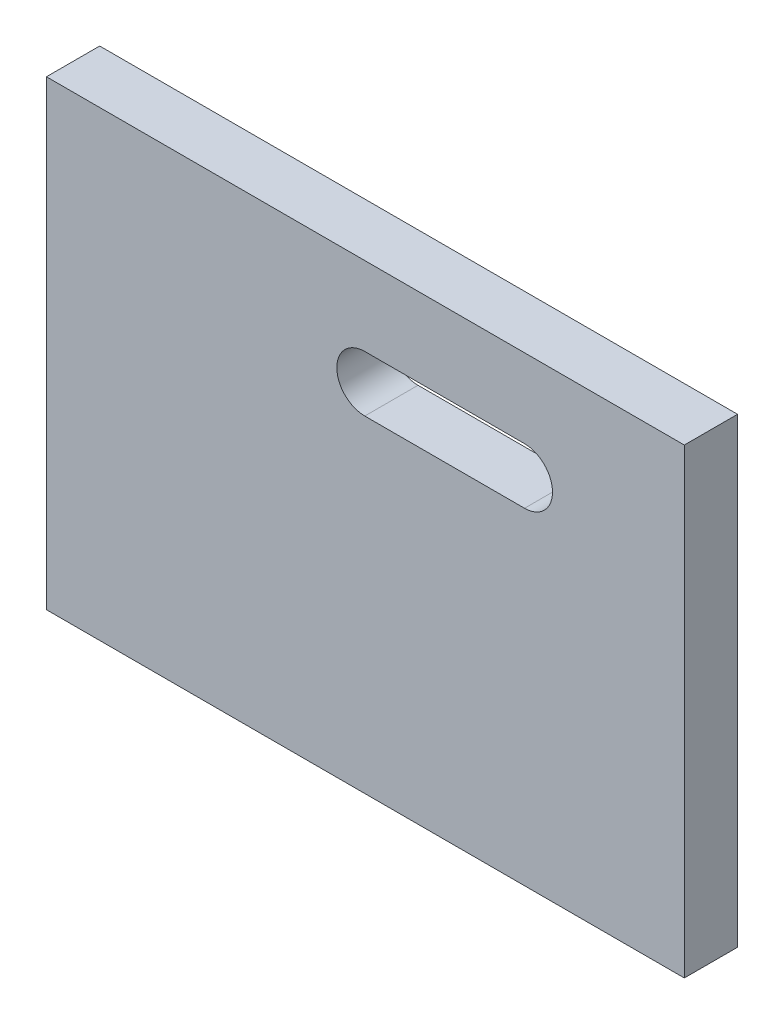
ISO-10303-21;
HEADER;
FILE_DESCRIPTION(('STEP AP214'),'2;1');
FILE_NAME('part.step','',(''),(''),'','','');
FILE_SCHEMA(('AUTOMOTIVE_DESIGN { 1 0 10303 214 1 1 1 1 }'));
ENDSEC;
DATA;
#1=APPLICATION_CONTEXT('core data for automotive mechanical design processes');
#2=APPLICATION_PROTOCOL_DEFINITION('international standard','automotive_design',2000,#1);
#3=PRODUCT_CONTEXT('',#1,'mechanical');
#4=PRODUCT('Part','Part','',(#3));
#5=PRODUCT_RELATED_PRODUCT_CATEGORY('part','',(#4));
#6=PRODUCT_DEFINITION_FORMATION('','',#4);
#7=PRODUCT_DEFINITION_CONTEXT('part definition',#1,'design');
#8=PRODUCT_DEFINITION('design','',#6,#7);
#9=PRODUCT_DEFINITION_SHAPE('','',#8);
#10=(LENGTH_UNIT() NAMED_UNIT(*) SI_UNIT(.MILLI.,.METRE.));
#11=(NAMED_UNIT(*) PLANE_ANGLE_UNIT() SI_UNIT($,.RADIAN.));
#12=(NAMED_UNIT(*) SI_UNIT($,.STERADIAN.) SOLID_ANGLE_UNIT());
#13=UNCERTAINTY_MEASURE_WITH_UNIT(LENGTH_MEASURE(1.E-05),#10,'distance_accuracy_value','');
#14=(GEOMETRIC_REPRESENTATION_CONTEXT(3) GLOBAL_UNCERTAINTY_ASSIGNED_CONTEXT((#13)) GLOBAL_UNIT_ASSIGNED_CONTEXT((#10,
#11,#12)) REPRESENTATION_CONTEXT('',''));
#15=CARTESIAN_POINT('',(0.,0.,0.));
#16=DIRECTION('',(0.,0.,1.));
#17=DIRECTION('',(1.,0.,0.));
#18=AXIS2_PLACEMENT_3D('',#15,#16,#17);
#19=CARTESIAN_POINT('',(-71.6424785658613,-40.9755851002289,10.));
#20=DIRECTION('',(0.,0.,1.));
#21=DIRECTION('',(1.,0.,0.));
#22=AXIS2_PLACEMENT_3D('',#19,#20,#21);
#23=PLANE('',#22);
#24=DIRECTION('',(0.,-1.,0.));
#25=VECTOR('',#24,1.);
#26=CARTESIAN_POINT('',(-71.6424785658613,45.6972130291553,10.));
#27=LINE('',#26,#25);
#28=CARTESIAN_POINT('',(-71.6424785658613,45.6972130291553,10.));
#29=VERTEX_POINT('',#28);
#30=CARTESIAN_POINT('',(-71.6424785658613,-40.9755851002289,10.));
#31=VERTEX_POINT('',#30);
#32=EDGE_CURVE('E142',#29,#31,#27,.T.);
#33=ORIENTED_EDGE('',*,*,#32,.T.);
#34=DIRECTION('',(1.,0.,0.));
#35=VECTOR('',#34,1.);
#36=CARTESIAN_POINT('',(-71.6424785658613,-40.9755851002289,10.));
#37=LINE('',#36,#35);
#38=CARTESIAN_POINT('',(48.1314886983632,-40.9755851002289,10.));
#39=VERTEX_POINT('',#38);
#40=EDGE_CURVE('E145',#31,#39,#37,.T.);
#41=ORIENTED_EDGE('',*,*,#40,.T.);
#42=DIRECTION('',(0.,1.,0.));
#43=VECTOR('',#42,1.);
#44=CARTESIAN_POINT('',(48.1314886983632,45.6972130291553,10.));
#45=LINE('',#44,#43);
#46=CARTESIAN_POINT('',(48.1314886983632,45.6972130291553,10.));
#47=VERTEX_POINT('',#46);
#48=EDGE_CURVE('E147',#39,#47,#45,.T.);
#49=ORIENTED_EDGE('',*,*,#48,.T.);
#50=DIRECTION('',(-1.,0.,0.));
#51=VECTOR('',#50,1.);
#52=CARTESIAN_POINT('',(-71.6424785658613,45.6972130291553,10.));
#53=LINE('',#52,#51);
#54=EDGE_CURVE('E149',#47,#29,#53,.T.);
#55=ORIENTED_EDGE('',*,*,#54,.T.);
#56=EDGE_LOOP('',(#33,#41,#49,#55));
#57=FACE_BOUND('',#56,.T.);
#58=DIRECTION('',(-1.,0.,0.));
#59=VECTOR('',#58,1.);
#60=CARTESIAN_POINT('',(18.1314886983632,30.9122948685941,10.));
#61=LINE('',#60,#59);
#62=CARTESIAN_POINT('',(18.1314886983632,30.9122948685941,10.));
#63=VERTEX_POINT('',#62);
#64=CARTESIAN_POINT('',(-11.8685113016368,30.9122948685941,10.));
#65=VERTEX_POINT('',#64);
#66=EDGE_CURVE('E124',#63,#65,#61,.T.);
#67=ORIENTED_EDGE('',*,*,#66,.F.);
#68=CARTESIAN_POINT('',(18.1314886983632,25.6622948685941,10.));
#69=DIRECTION('',(0.,0.,1.));
#70=DIRECTION('',(1.,0.,0.));
#71=AXIS2_PLACEMENT_3D('',#68,#69,#70);
#72=CIRCLE('',#71,5.25);
#73=CARTESIAN_POINT('',(18.1314886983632,20.4122948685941,10.));
#74=VERTEX_POINT('',#73);
#75=EDGE_CURVE('E113',#74,#63,#72,.T.);
#76=ORIENTED_EDGE('',*,*,#75,.F.);
#77=DIRECTION('',(1.,0.,0.));
#78=VECTOR('',#77,1.);
#79=CARTESIAN_POINT('',(-11.8685113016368,20.4122948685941,10.));
#80=LINE('',#79,#78);
#81=CARTESIAN_POINT('',(-11.8685113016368,20.4122948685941,10.));
#82=VERTEX_POINT('',#81);
#83=EDGE_CURVE('E128',#82,#74,#80,.T.);
#84=ORIENTED_EDGE('',*,*,#83,.F.);
#85=CARTESIAN_POINT('',(-11.8685113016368,25.6622948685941,10.));
#86=DIRECTION('',(0.,0.,1.));
#87=DIRECTION('',(1.,0.,0.));
#88=AXIS2_PLACEMENT_3D('',#85,#86,#87);
#89=CIRCLE('',#88,5.25);
#90=EDGE_CURVE('E126',#65,#82,#89,.T.);
#91=ORIENTED_EDGE('',*,*,#90,.F.);
#92=EDGE_LOOP('',(#67,#76,#84,#91));
#93=FACE_BOUND('',#92,.T.);
#94=ADVANCED_FACE('F33',(#57,#93),#23,.T.);
#95=CARTESIAN_POINT('',(-71.6424785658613,-40.9755851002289,0.));
#96=DIRECTION('',(0.,0.,1.));
#97=DIRECTION('',(1.,0.,0.));
#98=AXIS2_PLACEMENT_3D('',#95,#96,#97);
#99=PLANE('',#98);
#100=DIRECTION('',(0.,-1.,0.));
#101=VECTOR('',#100,1.);
#102=CARTESIAN_POINT('',(-71.6424785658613,45.6972130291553,0.));
#103=LINE('',#102,#101);
#104=CARTESIAN_POINT('',(-71.6424785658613,45.6972130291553,0.));
#105=VERTEX_POINT('',#104);
#106=CARTESIAN_POINT('',(-71.6424785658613,-40.9755851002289,0.));
#107=VERTEX_POINT('',#106);
#108=EDGE_CURVE('E114',#105,#107,#103,.T.);
#109=ORIENTED_EDGE('',*,*,#108,.F.);
#110=DIRECTION('',(-1.,0.,0.));
#111=VECTOR('',#110,1.);
#112=CARTESIAN_POINT('',(-71.6424785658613,45.6972130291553,0.));
#113=LINE('',#112,#111);
#114=CARTESIAN_POINT('',(48.1314886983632,45.6972130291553,0.));
#115=VERTEX_POINT('',#114);
#116=EDGE_CURVE('E140',#115,#105,#113,.T.);
#117=ORIENTED_EDGE('',*,*,#116,.F.);
#118=DIRECTION('',(0.,1.,0.));
#119=VECTOR('',#118,1.);
#120=CARTESIAN_POINT('',(48.1314886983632,45.6972130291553,0.));
#121=LINE('',#120,#119);
#122=CARTESIAN_POINT('',(48.1314886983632,-40.9755851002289,0.));
#123=VERTEX_POINT('',#122);
#124=EDGE_CURVE('E138',#123,#115,#121,.T.);
#125=ORIENTED_EDGE('',*,*,#124,.F.);
#126=DIRECTION('',(1.,0.,0.));
#127=VECTOR('',#126,1.);
#128=CARTESIAN_POINT('',(-71.6424785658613,-40.9755851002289,0.));
#129=LINE('',#128,#127);
#130=EDGE_CURVE('E136',#107,#123,#129,.T.);
#131=ORIENTED_EDGE('',*,*,#130,.F.);
#132=EDGE_LOOP('',(#109,#117,#125,#131));
#133=FACE_BOUND('',#132,.T.);
#134=CARTESIAN_POINT('',(18.1314886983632,25.6622948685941,0.));
#135=DIRECTION('',(0.,0.,1.));
#136=DIRECTION('',(1.,0.,0.));
#137=AXIS2_PLACEMENT_3D('',#134,#135,#136);
#138=CIRCLE('',#137,5.25);
#139=CARTESIAN_POINT('',(18.1314886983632,20.4122948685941,0.));
#140=VERTEX_POINT('',#139);
#141=CARTESIAN_POINT('',(18.1314886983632,30.9122948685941,0.));
#142=VERTEX_POINT('',#141);
#143=EDGE_CURVE('E56',#140,#142,#138,.T.);
#144=ORIENTED_EDGE('',*,*,#143,.T.);
#145=DIRECTION('',(-1.,0.,0.));
#146=VECTOR('',#145,1.);
#147=CARTESIAN_POINT('',(18.1314886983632,30.9122948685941,0.));
#148=LINE('',#147,#146);
#149=CARTESIAN_POINT('',(-11.8685113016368,30.9122948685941,0.));
#150=VERTEX_POINT('',#149);
#151=EDGE_CURVE('E100',#142,#150,#148,.T.);
#152=ORIENTED_EDGE('',*,*,#151,.T.);
#153=CARTESIAN_POINT('',(-11.8685113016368,25.6622948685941,0.));
#154=DIRECTION('',(0.,0.,1.));
#155=DIRECTION('',(1.,0.,0.));
#156=AXIS2_PLACEMENT_3D('',#153,#154,#155);
#157=CIRCLE('',#156,5.25);
#158=CARTESIAN_POINT('',(-11.8685113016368,20.4122948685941,0.));
#159=VERTEX_POINT('',#158);
#160=EDGE_CURVE('E109',#150,#159,#157,.T.);
#161=ORIENTED_EDGE('',*,*,#160,.T.);
#162=DIRECTION('',(1.,0.,0.));
#163=VECTOR('',#162,1.);
#164=CARTESIAN_POINT('',(-11.8685113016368,20.4122948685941,0.));
#165=LINE('',#164,#163);
#166=EDGE_CURVE('E118',#159,#140,#165,.T.);
#167=ORIENTED_EDGE('',*,*,#166,.T.);
#168=EDGE_LOOP('',(#144,#152,#161,#167));
#169=FACE_BOUND('',#168,.T.);
#170=ADVANCED_FACE('F117',(#133,#169),#99,.F.);
#171=CARTESIAN_POINT('',(-71.6424785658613,45.6972130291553,10.));
#172=DIRECTION('',(1.,0.,0.));
#173=DIRECTION('',(0.,0.,-1.));
#174=AXIS2_PLACEMENT_3D('',#171,#172,#173);
#175=PLANE('',#174);
#176=ORIENTED_EDGE('',*,*,#108,.T.);
#177=DIRECTION('',(0.,0.,-1.));
#178=VECTOR('',#177,1.);
#179=CARTESIAN_POINT('',(-71.6424785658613,-40.9755851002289,10.));
#180=LINE('',#179,#178);
#181=EDGE_CURVE('E11',#31,#107,#180,.T.);
#182=ORIENTED_EDGE('',*,*,#181,.F.);
#183=ORIENTED_EDGE('',*,*,#32,.F.);
#184=DIRECTION('',(0.,0.,-1.));
#185=VECTOR('',#184,1.);
#186=CARTESIAN_POINT('',(-71.6424785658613,45.6972130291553,10.));
#187=LINE('',#186,#185);
#188=EDGE_CURVE('E151',#29,#105,#187,.T.);
#189=ORIENTED_EDGE('',*,*,#188,.T.);
#190=EDGE_LOOP('',(#176,#182,#183,#189));
#191=FACE_BOUND('',#190,.T.);
#192=ADVANCED_FACE('F35',(#191),#175,.F.);
#193=CARTESIAN_POINT('',(-71.6424785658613,-40.9755851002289,10.));
#194=DIRECTION('',(0.,1.,0.));
#195=DIRECTION('',(0.,0.,1.));
#196=AXIS2_PLACEMENT_3D('',#193,#194,#195);
#197=PLANE('',#196);
#198=ORIENTED_EDGE('',*,*,#130,.T.);
#199=DIRECTION('',(0.,0.,-1.));
#200=VECTOR('',#199,1.);
#201=CARTESIAN_POINT('',(48.1314886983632,-40.9755851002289,10.));
#202=LINE('',#201,#200);
#203=EDGE_CURVE('E41',#39,#123,#202,.T.);
#204=ORIENTED_EDGE('',*,*,#203,.F.);
#205=ORIENTED_EDGE('',*,*,#40,.F.);
#206=ORIENTED_EDGE('',*,*,#181,.T.);
#207=EDGE_LOOP('',(#198,#204,#205,#206));
#208=FACE_BOUND('',#207,.T.);
#209=ADVANCED_FACE('F176',(#208),#197,.F.);
#210=CARTESIAN_POINT('',(48.1314886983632,45.6972130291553,10.));
#211=DIRECTION('',(-1.,0.,0.));
#212=DIRECTION('',(0.,-1.,0.));
#213=AXIS2_PLACEMENT_3D('',#210,#211,#212);
#214=PLANE('',#213);
#215=ORIENTED_EDGE('',*,*,#124,.T.);
#216=DIRECTION('',(0.,0.,-1.));
#217=VECTOR('',#216,1.);
#218=CARTESIAN_POINT('',(48.1314886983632,45.6972130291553,10.));
#219=LINE('',#218,#217);
#220=EDGE_CURVE('E154',#47,#115,#219,.T.);
#221=ORIENTED_EDGE('',*,*,#220,.F.);
#222=ORIENTED_EDGE('',*,*,#48,.F.);
#223=ORIENTED_EDGE('',*,*,#203,.T.);
#224=EDGE_LOOP('',(#215,#221,#222,#223));
#225=FACE_BOUND('',#224,.T.);
#226=ADVANCED_FACE('F161',(#225),#214,.F.);
#227=CARTESIAN_POINT('',(-71.6424785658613,45.6972130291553,10.));
#228=DIRECTION('',(0.,-1.,0.));
#229=DIRECTION('',(0.,0.,-1.));
#230=AXIS2_PLACEMENT_3D('',#227,#228,#229);
#231=PLANE('',#230);
#232=ORIENTED_EDGE('',*,*,#116,.T.);
#233=ORIENTED_EDGE('',*,*,#188,.F.);
#234=ORIENTED_EDGE('',*,*,#54,.F.);
#235=ORIENTED_EDGE('',*,*,#220,.T.);
#236=EDGE_LOOP('',(#232,#233,#234,#235));
#237=FACE_BOUND('',#236,.T.);
#238=ADVANCED_FACE('F169',(#237),#231,.F.);
#239=CARTESIAN_POINT('',(18.1314886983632,25.6622948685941,10.));
#240=DIRECTION('',(0.,0.,-1.));
#241=DIRECTION('',(-1.,0.,0.));
#242=AXIS2_PLACEMENT_3D('',#239,#240,#241);
#243=CYLINDRICAL_SURFACE('',#242,5.25);
#244=ORIENTED_EDGE('',*,*,#143,.F.);
#245=DIRECTION('',(0.,0.,-1.));
#246=VECTOR('',#245,1.);
#247=CARTESIAN_POINT('',(18.1314886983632,20.4122948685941,10.));
#248=LINE('',#247,#246);
#249=EDGE_CURVE('E130',#74,#140,#248,.T.);
#250=ORIENTED_EDGE('',*,*,#249,.F.);
#251=ORIENTED_EDGE('',*,*,#75,.T.);
#252=DIRECTION('',(0.,0.,-1.));
#253=VECTOR('',#252,1.);
#254=CARTESIAN_POINT('',(18.1314886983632,30.9122948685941,10.));
#255=LINE('',#254,#253);
#256=EDGE_CURVE('E102',#63,#142,#255,.T.);
#257=ORIENTED_EDGE('',*,*,#256,.T.);
#258=EDGE_LOOP('',(#244,#250,#251,#257));
#259=FACE_BOUND('',#258,.T.);
#260=ADVANCED_FACE('F111',(#259),#243,.F.);
#261=CARTESIAN_POINT('',(18.1314886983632,30.9122948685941,10.));
#262=DIRECTION('',(0.,-1.,0.));
#263=DIRECTION('',(0.,0.,-1.));
#264=AXIS2_PLACEMENT_3D('',#261,#262,#263);
#265=PLANE('',#264);
#266=ORIENTED_EDGE('',*,*,#151,.F.);
#267=ORIENTED_EDGE('',*,*,#256,.F.);
#268=ORIENTED_EDGE('',*,*,#66,.T.);
#269=DIRECTION('',(0.,0.,-1.));
#270=VECTOR('',#269,1.);
#271=CARTESIAN_POINT('',(-11.8685113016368,30.9122948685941,10.));
#272=LINE('',#271,#270);
#273=EDGE_CURVE('E105',#65,#150,#272,.T.);
#274=ORIENTED_EDGE('',*,*,#273,.T.);
#275=EDGE_LOOP('',(#266,#267,#268,#274));
#276=FACE_BOUND('',#275,.T.);
#277=ADVANCED_FACE('F101',(#276),#265,.T.);
#278=CARTESIAN_POINT('',(-11.8685113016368,25.6622948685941,10.));
#279=DIRECTION('',(0.,0.,-1.));
#280=DIRECTION('',(-1.,0.,0.));
#281=AXIS2_PLACEMENT_3D('',#278,#279,#280);
#282=CYLINDRICAL_SURFACE('',#281,5.25);
#283=ORIENTED_EDGE('',*,*,#160,.F.);
#284=ORIENTED_EDGE('',*,*,#273,.F.);
#285=ORIENTED_EDGE('',*,*,#90,.T.);
#286=DIRECTION('',(0.,0.,-1.));
#287=VECTOR('',#286,1.);
#288=CARTESIAN_POINT('',(-11.8685113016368,20.4122948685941,10.));
#289=LINE('',#288,#287);
#290=EDGE_CURVE('E48',#82,#159,#289,.T.);
#291=ORIENTED_EDGE('',*,*,#290,.T.);
#292=EDGE_LOOP('',(#283,#284,#285,#291));
#293=FACE_BOUND('',#292,.T.);
#294=ADVANCED_FACE('F198',(#293),#282,.F.);
#295=CARTESIAN_POINT('',(-11.8685113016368,20.4122948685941,10.));
#296=DIRECTION('',(0.,1.,0.));
#297=DIRECTION('',(0.,0.,1.));
#298=AXIS2_PLACEMENT_3D('',#295,#296,#297);
#299=PLANE('',#298);
#300=ORIENTED_EDGE('',*,*,#166,.F.);
#301=ORIENTED_EDGE('',*,*,#290,.F.);
#302=ORIENTED_EDGE('',*,*,#83,.T.);
#303=ORIENTED_EDGE('',*,*,#249,.T.);
#304=EDGE_LOOP('',(#300,#301,#302,#303));
#305=FACE_BOUND('',#304,.T.);
#306=ADVANCED_FACE('F203',(#305),#299,.T.);
#307=CLOSED_SHELL('',(#94,#170,#192,#209,#226,#238,#260,#277,#294,#306));
#308=MANIFOLD_SOLID_BREP('B2',#307);
#309=ADVANCED_BREP_SHAPE_REPRESENTATION('',(#18,#308),#14);
#310=SHAPE_DEFINITION_REPRESENTATION(#9,#309);
ENDSEC;
END-ISO-10303-21;
